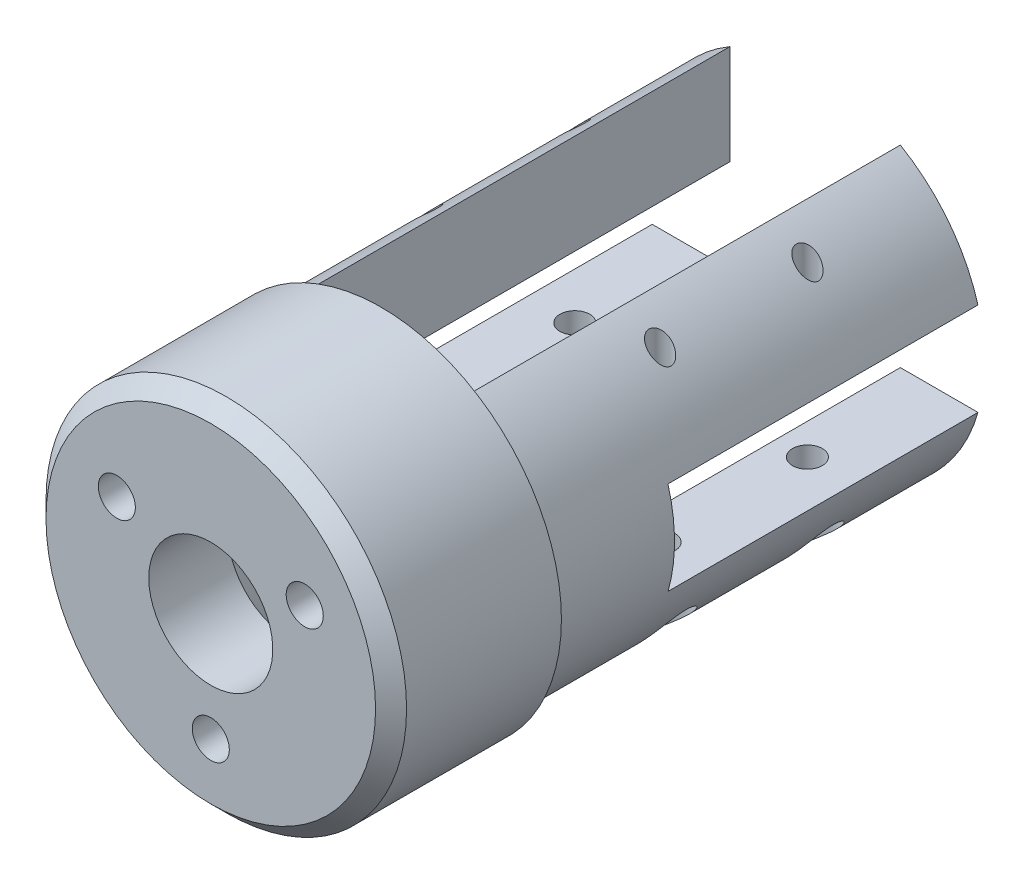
from build123d import *

# Parameters (mm, degrees)
CUT_EXTRUDE1_DEPTH    = 44.45
HOLE1_D               = 12.7
CUT_EXTRUDE2_DEPTH    = 31.75
CIRPATTERN1_COUNT     = 3
F_4_40_TAPPED_HOLE2_D = 2.2606
LPATTERN2_COUNT       = 2
LPATTERN2_PITCH       = 15.0876
MIRROR1_COPY_2_D      = 2.2606
CUT_EXTRUDE4_REACH    = 43.11
SKETCH17_W            = 3.18135
SKETCH17_H            = 9.525
CHAMFER1_SIZE         = 1.5875


with BuildPart() as part:
    # Sketch1 → Revolve1 (revolve)
    with BuildSketch(Plane(origin=(0, 0, 0), x_dir=(0, 0, -1), z_dir=(1, 0, 0)), mode=Mode.PRIVATE) as revolve1_sk:
        Polygon((-30.9499, 0), (-30.9499, 18.4658), (-13.5001, 18.4658), (-13.5001, 17.3482), (30.9499, 17.3482), (30.9499, 0), align=None)
    revolve(revolve1_sk.sketch.rotate(Axis((0, 0, 56.796627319), (0, 0, -1)), 90), axis=Axis((0, 0, 56.796627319), (0, 0, -1)))

    # Sketch2 → Cut-Extrude1 (cut)
    with BuildSketch(Plane(origin=(0, 0, -30.9499), x_dir=(-1, 0, 0), z_dir=(0, 0, -1))):
        with BuildLine():
            Line((8.73125, -4.7498), (8.73125, 4.7752))
            Line((8.73125, 4.7752), (8.73125, 14.990841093))
            ThreePointArc((8.73125, 14.990841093), (0, 17.3482), (-8.73125, 14.990841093))
            Line((-8.73125, 14.990841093), (-8.73125, 4.7752))
            Line((-8.73125, 4.7752), (-8.73125, -4.7498))
            Line((-8.73125, -4.7498), (-8.73125, -14.990841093))
            ThreePointArc((-8.73125, -14.990841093), (0, -17.3482), (8.73125, -14.990841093))
            Line((8.73125, -14.990841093), (8.73125, -4.7498))
        make_face()
    extrude(amount=-CUT_EXTRUDE1_DEPTH, mode=Mode.SUBTRACT)

    # Hole1 (through all)
    with Locations(Plane(origin=(0, 0, 13.5001), x_dir=(-1, 0, 0), z_dir=(0, 0, -1))):
        with Locations((0, 0)):
            Hole(HOLE1_D / 2)

    # Sketch2_3 → Cut-Extrude2 (cut)
    with BuildSketch(Plane(origin=(0, 0, -30.9499), x_dir=(-1, 0, 0), z_dir=(0, 0, -1))):
        with BuildLine():
            Line((-8.73125, -4.7498), (-8.73125, 4.7752))
            Line((-8.73125, 4.7752), (-16.678054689, 4.7752))
            ThreePointArc((-16.678054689, 4.7752), (-17.348194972, 0.013207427), (-16.685306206, -4.7498))
            Line((-16.685306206, -4.7498), (-8.73125, -4.7498))
        make_face()
        with BuildLine():
            Line((16.678054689, 4.7752), (8.73125, 4.7752))
            Line((8.73125, 4.7752), (8.73125, -4.7498))
            Line((8.73125, -4.7498), (16.685306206, -4.7498))
            ThreePointArc((16.685306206, -4.7498), (17.181677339, -2.397917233), (17.3482, 0))
            ThreePointArc((17.3482, 0), (17.179846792, 2.410997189), (16.678054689, 4.7752))
        make_face()
    extrude(amount=-CUT_EXTRUDE2_DEPTH, mode=Mode.SUBTRACT)

    # Sketch7 → 10-24 Tapped Hole1 (revolve, cut)
    with BuildSketch(Plane(origin=(0, -11.1125, 30.9499), x_dir=(0, -1, 0), z_dir=(1, 0, 0))):
        Polygon((0, 0), (0, 15.415624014), (1.89865, 14.2748), (1.89865, 0), align=None)
    f_10_24_tapped_hole1 = revolve(axis=Axis((0, -11.1125, 37.2999), (0, 0, -1)), mode=Mode.SUBTRACT)

    # CirPattern1: 10-24 Tapped Hole1 ×3 about axis
    cirpattern1_axis = Axis((0, 0, 0), (0, 0, 1))
    for i in range(1, CIRPATTERN1_COUNT):
        add(f_10_24_tapped_hole1.rotate(cirpattern1_axis, i * 360 / CIRPATTERN1_COUNT), mode=Mode.SUBTRACT)

    # Sketch9 → 13_16 _0.8125_ Diameter Hole1 (revolve, cut)
    with BuildSketch(Plane(origin=(0, 0, 13.5001), x_dir=(0, 1, 0), z_dir=(1, 0, 0))):
        Polygon((0, 0), (0, 16.632864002), (10.31875, 4.7625), (10.31875, 0), align=None)
    revolve(axis=Axis((0, 0, 7.1501), (0, 0, 1)), mode=Mode.SUBTRACT)

    # Sketch12 → Hole2 (revolve, cut)
    with BuildSketch(Plane(origin=(-11.9126, -14.990841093, -3.1623), x_dir=(0, 0, -1), z_dir=(1, 0, 0))):
        Polygon((0, 0), (0, 13.615711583), (1.524, 12.7), (1.524, 7.0485), (2.667, 7.0485), (2.667, 0), align=None)
    hole2 = revolve(axis=Axis((-11.9126, -26.301716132, -3.1623), (0, 1, 0)), mode=Mode.SUBTRACT)

    # 4-40 Tapped Hole2 (through all)
    with Locations(Plane.XZ.offset(-4.7752)):
        with Locations((-11.9126, -3.1623)):
            f_4_40_tapped_hole2 = Hole(F_4_40_TAPPED_HOLE2_D / 2)

    # LPattern2: Hole2, 4-40 Tapped Hole2 ×2
    with Locations(*[(0, 0, -i * LPATTERN2_PITCH) for i in range(1, LPATTERN2_COUNT)]):
        add(hole2, mode=Mode.SUBTRACT)
        add(f_4_40_tapped_hole2, mode=Mode.SUBTRACT)

    # Mirror1: Hole2, 4-40 Tapped Hole2 across plane
    add(hole2.mirror(Plane(origin=(0, 0, 0), x_dir=(0, 0, 1), z_dir=(1, 0, 0))), mode=Mode.SUBTRACT)
    add(f_4_40_tapped_hole2.mirror(Plane(origin=(0, 0, 0), x_dir=(0, 0, 1), z_dir=(1, 0, 0))), mode=Mode.SUBTRACT)

    # Mirror1 copy 1 sketch → Mirror1 copy 1 (revolve, cut)
    with BuildSketch(Plane(origin=(11.9126, -14.990841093, -18.2499), x_dir=(0, 0, -1), z_dir=(-1, 0, 0))):
        Polygon((0, 0), (0, -13.615711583), (1.524, -12.7), (1.524, -7.0485), (2.667, -7.0485), (2.667, 0), align=None)
    revolve(axis=Axis((11.9126, -26.301716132, -18.2499), (0, -1, 0)), mode=Mode.SUBTRACT)

    # Mirror1 copy 2 (through all)
    with Locations(Plane(origin=(0, 4.7752, -15.0876), x_dir=(-1, 0, 0), z_dir=(0, -1, 0))):
        with Locations((-11.9126, 3.1623)):
            Hole(MIRROR1_COPY_2_D / 2)

    # Sketch14 → Hole3 (revolve, cut)
    with BuildSketch(Plane(origin=(11.9126, 0, 0.8001), x_dir=(0, 1, 0), z_dir=(1, 0, 0))):
        Polygon((0, 0), (0, 18.736598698), (4.7625, 15.875), (4.7625, 0), align=None)
    hole3 = revolve(axis=Axis((11.9126, 0, -3.444099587), (0, 0, 1)), mode=Mode.SUBTRACT)

    # Cut-Extrude4: up to this cone (the profile starts inside it)
    cut_extrude4_end = Plane(origin=(0, 0, 0.8001), z_dir=(0, 0, -1)).offset(-29.332863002) * Cone(1e-06, 85.573919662, 98.441532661, align=(Align.CENTER, Align.CENTER, Align.MIN), mode=Mode.PRIVATE)
    # Sketch17 → Cut-Extrude4 (cut, up to the surface)
    with BuildSketch(Plane(origin=(0, 0, 0.8001), x_dir=(-1, 0, 0), z_dir=(0, 0, -1)), mode=Mode.PRIVATE) as cut_extrude4_sk1:
        with Locations((-10.321925, 0.0127)):
            Rectangle(SKETCH17_W, SKETCH17_H)
    cut_extrude4_tool1 = extrude(cut_extrude4_sk1.sketch, amount=-CUT_EXTRUDE4_REACH, mode=Mode.PRIVATE) & cut_extrude4_end
    cut_extrude4 = cut_extrude4_tool1.solids().sort_by_distance((10.321925, 0.0127, 0.8001))[0]
    add(cut_extrude4, mode=Mode.SUBTRACT)

    # Mirror2: Hole3, Cut-Extrude4 across plane
    add(hole3.mirror(Plane(origin=(0, 0, 0), x_dir=(0, 0, 1), z_dir=(1, 0, 0))), mode=Mode.SUBTRACT)
    add(cut_extrude4.mirror(Plane(origin=(0, 0, 0), x_dir=(0, 0, 1), z_dir=(1, 0, 0))), mode=Mode.SUBTRACT)

    # Chamfer1
    chamfer1_edges = [part.edges().sort_by_distance(p)[0] for p in [
        (-18.4658, 0, 30.9499),
    ]]
    chamfer(chamfer1_edges, length=CHAMFER1_SIZE)


solid = part.part
